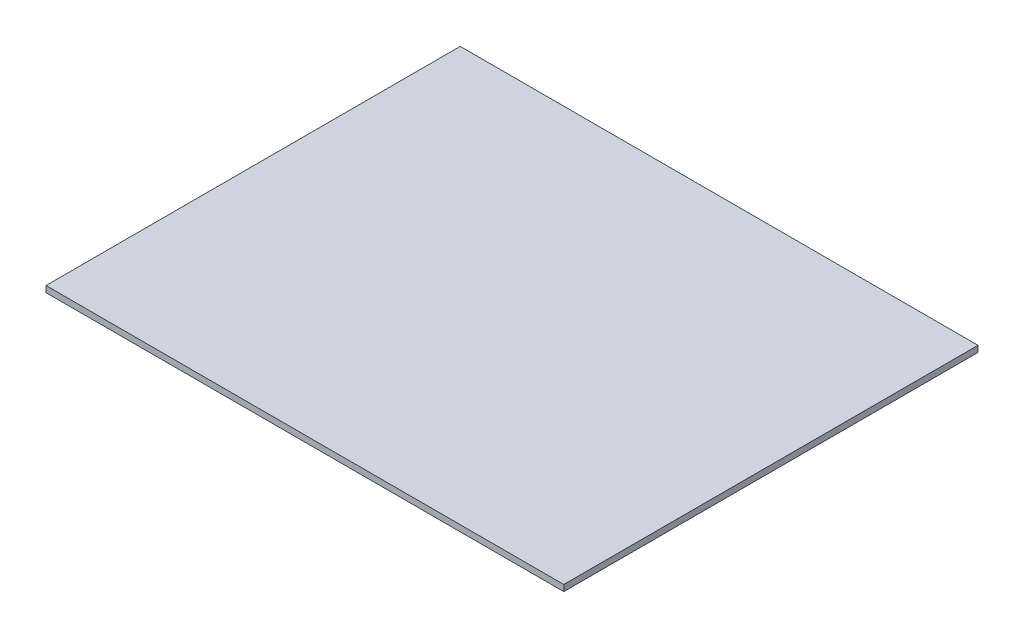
from build123d import *

# Parameters (mm, degrees)
SKETCH1_W           = 2438.4
SKETCH1_H           = 1219.2
BOSS_EXTRUDE1_DEPTH = 18.25625
SKETCH2_W           = 914.4
SKETCH2_H           = 1219.2
CUT_EXTRUDE1_DEPTH  = 1364.229287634


with BuildPart() as part:
    # Sketch1 → Boss-Extrude1 (new body)
    with BuildSketch(Plane(origin=(0, 0, 0), x_dir=(1, 0, 0), z_dir=(0, 1, 0))):
        Rectangle(SKETCH1_W, SKETCH1_H)
    extrude(amount=BOSS_EXTRUDE1_DEPTH)

    # Sketch2 → Cut-Extrude1 (cut, through all)
    with BuildSketch(Plane(origin=(0, 18.25625, 0), x_dir=(1, 0, 0), z_dir=(0, 1, 0))):
        with Locations((762, 0)):
            Rectangle(SKETCH2_W, SKETCH2_H)
    extrude(amount=-CUT_EXTRUDE1_DEPTH, mode=Mode.SUBTRACT)


solid = part.part
